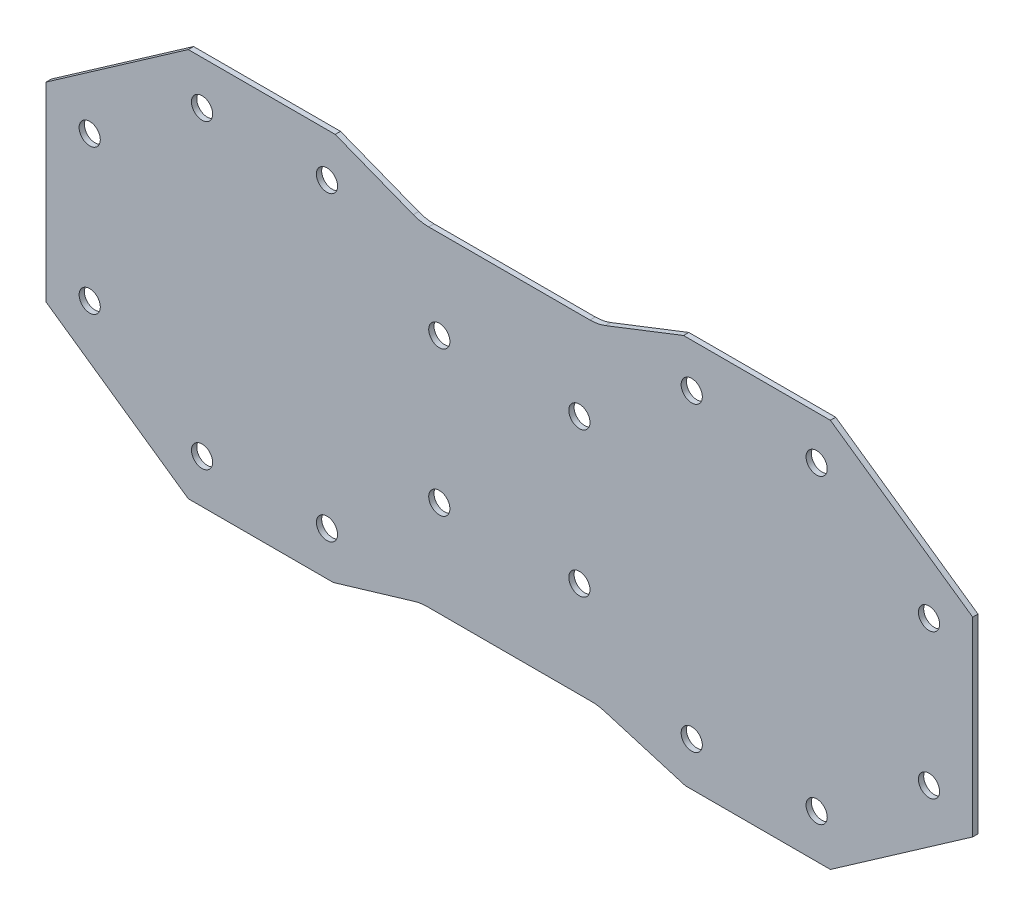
from build123d import *

# Parameters (mm, degrees)
MAIN_PLATE_DEPTH        = 12.7
CUT_EXTRUDE1_DEPTH      = 1761.764429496
CUT_EXTRUDE1_DEPTH_BACK = 1761.764429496
SKETCH5_R               = 25.4


with BuildPart() as part:
    # Sketch3 → Main Plate (new body)
    with BuildSketch(Plane(origin=(0, 0, 0), x_dir=(0, 1, 0), z_dir=(0, 0, 1))):
        with BuildLine():
            Line((466.324268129, 169.476784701), (466.324268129, -182.70492307))
            Line((466.324268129, -182.70492307), (228.234235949, -523.855268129))
            Line((228.234235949, -523.855268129), (-228.234235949, -523.855268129))
            Line((-228.234235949, -523.855268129), (-466.324268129, -182.70492307))
            Line((-466.324268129, -182.70492307), (-466.324268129, 165.037979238))
            Line((-466.324268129, 165.037979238), (-408.138164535, 360.294702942))
            ThreePointArc((-408.138164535, 360.294702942), (-404.970208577, 374.649076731), (-403.906803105, 389.310357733))
            Line((-403.906803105, 389.310357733), (-403.906803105, 784.677642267))
            ThreePointArc((-403.906803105, 784.677642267), (-404.970208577, 799.338923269), (-408.138164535, 813.693297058))
            Line((-408.138164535, 813.693297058), (-466.324268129, 1008.950020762))
            Line((-466.324268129, 1008.950020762), (-466.324268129, 1356.69292307))
            Line((-466.324268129, 1356.69292307), (-228.234235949, 1697.843268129))
            Line((-228.234235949, 1697.843268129), (228.234235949, 1697.843268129))
            Line((228.234235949, 1697.843268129), (466.324268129, 1356.69292307))
            Line((466.324268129, 1356.69292307), (466.324268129, 1004.511215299))
            Line((466.324268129, 1004.511215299), (393.274931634, 817.306570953))
            ThreePointArc((393.274931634, 817.306570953), (388.077053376, 799.164133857), (386.324268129, 780.37334606))
            Line((386.324268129, 780.37334606), (386.324268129, 393.61465394))
            ThreePointArc((386.324268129, 393.61465394), (388.077053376, 374.823866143), (393.274931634, 356.681429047))
            Line((393.274931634, 356.681429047), (466.324268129, 169.476784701))
        make_face()
    extrude(amount=MAIN_PLATE_DEPTH)

    # Sketch5 → Cut-Extrude1 (cut, two sides: drawn at the far end of the back side and taken through both)
    with BuildSketch(Plane(origin=(0, 0, 0), x_dir=(0, 1, 0), z_dir=(0, 0, 1)).offset(-CUT_EXTRUDE1_DEPTH_BACK)):
        with Locations(Location((-173.588730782, 419.080268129, 0), (0, 0, 270))):
            Circle(SKETCH5_R)
        with Locations(Location((173.588730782, 419.080268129, 0), (0, 0, 270))):
            Circle(SKETCH5_R)
        with Locations(Location((361.549268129, 149.758610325, 0), (0, 0, 270))):
            Circle(SKETCH5_R)
        with Locations(Location((361.549268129, -149.758610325, 0), (0, 0, 270))):
            Circle(SKETCH5_R)
        with Locations(Location((173.588730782, -419.080268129, 0), (0, 0, 270))):
            Circle(SKETCH5_R)
        with Locations(Location((-173.588730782, -419.080268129, 0), (0, 0, 270))):
            Circle(SKETCH5_R)
        with Locations(Location((-361.549268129, -149.758610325, 0), (0, 0, 270))):
            Circle(SKETCH5_R)
        with Locations(Location((-361.549268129, 149.758610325, 0), (0, 0, 270))):
            Circle(SKETCH5_R)
        with Locations(Location((-361.549268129, 1024.229389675, 0), (0, 0, 270))):
            Circle(SKETCH5_R)
        with Locations(Location((361.549268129, 1323.746610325, 0), (0, 0, 270))):
            Circle(SKETCH5_R)
        with Locations(Location((-173.588730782, 754.907731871, 0), (0, 0, 270))):
            Circle(SKETCH5_R)
        with Locations(Location((-173.588730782, 1593.068268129, 0), (0, 0, 270))):
            Circle(SKETCH5_R)
        with Locations(Location((361.549268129, 1024.229389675, 0), (0, 0, 270))):
            Circle(SKETCH5_R)
        with Locations(Location((173.588730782, 1593.068268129, 0), (0, 0, 270))):
            Circle(SKETCH5_R)
        with Locations(Location((173.588730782, 754.907731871, 0), (0, 0, 270))):
            Circle(SKETCH5_R)
        with Locations(Location((-361.549268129, 1323.746610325, 0), (0, 0, 270))):
            Circle(SKETCH5_R)
    extrude(amount=CUT_EXTRUDE1_DEPTH + CUT_EXTRUDE1_DEPTH_BACK, mode=Mode.SUBTRACT)


solid = part.part
